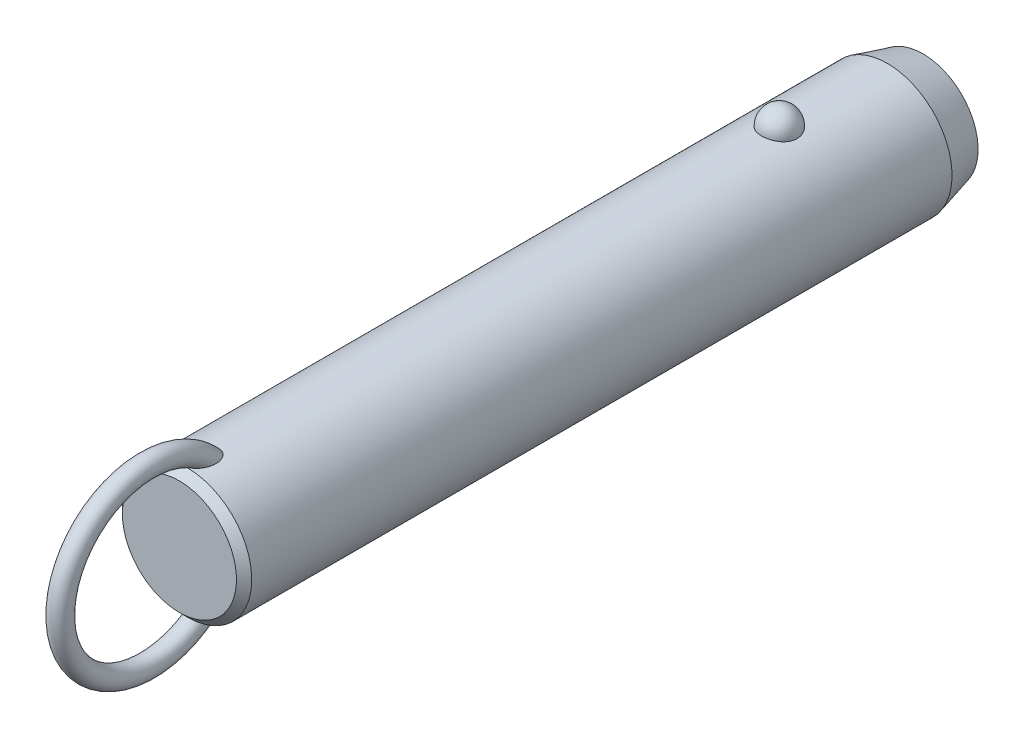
ISO-10303-21;
HEADER;
FILE_DESCRIPTION(('STEP AP214'),'2;1');
FILE_NAME('part.step','',(''),(''),'','','');
FILE_SCHEMA(('AUTOMOTIVE_DESIGN { 1 0 10303 214 1 1 1 1 }'));
ENDSEC;
DATA;
#1=APPLICATION_CONTEXT('core data for automotive mechanical design processes');
#2=APPLICATION_PROTOCOL_DEFINITION('international standard','automotive_design',2000,#1);
#3=PRODUCT_CONTEXT('',#1,'mechanical');
#4=PRODUCT('Part','Part','',(#3));
#5=PRODUCT_RELATED_PRODUCT_CATEGORY('part','',(#4));
#6=PRODUCT_DEFINITION_FORMATION('','',#4);
#7=PRODUCT_DEFINITION_CONTEXT('part definition',#1,'design');
#8=PRODUCT_DEFINITION('design','',#6,#7);
#9=PRODUCT_DEFINITION_SHAPE('','',#8);
#10=(LENGTH_UNIT() NAMED_UNIT(*) SI_UNIT(.MILLI.,.METRE.));
#11=(NAMED_UNIT(*) PLANE_ANGLE_UNIT() SI_UNIT($,.RADIAN.));
#12=(NAMED_UNIT(*) SI_UNIT($,.STERADIAN.) SOLID_ANGLE_UNIT());
#13=UNCERTAINTY_MEASURE_WITH_UNIT(LENGTH_MEASURE(1.E-05),#10,'distance_accuracy_value','');
#14=(GEOMETRIC_REPRESENTATION_CONTEXT(3) GLOBAL_UNCERTAINTY_ASSIGNED_CONTEXT((#13)) GLOBAL_UNIT_ASSIGNED_CONTEXT((#10,
#11,#12)) REPRESENTATION_CONTEXT('',''));
#15=CARTESIAN_POINT('',(0.,0.,0.));
#16=DIRECTION('',(0.,0.,1.));
#17=DIRECTION('',(1.,0.,0.));
#18=AXIS2_PLACEMENT_3D('',#15,#16,#17);
#19=CARTESIAN_POINT('',(0.,0.,101.6));
#20=DIRECTION('',(0.,0.,-1.));
#21=DIRECTION('',(-1.,0.,0.));
#22=AXIS2_PLACEMENT_3D('',#19,#20,#21);
#23=CYLINDRICAL_SURFACE('',#22,12.7);
#24=CARTESIAN_POINT('',(3.46661256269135,12.2177165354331,-3.5));
#25=CARTESIAN_POINT('',(3.4666090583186,12.2177194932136,-3.30432790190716));
#26=CARTESIAN_POINT('',(3.45063567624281,12.2222841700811,-3.10861112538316));
#27=CARTESIAN_POINT('',(3.38712451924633,12.2400345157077,-2.72271899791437));
#28=CARTESIAN_POINT('',(3.33957415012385,12.2532236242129,-2.53254588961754));
#29=CARTESIAN_POINT('',(3.2141234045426,12.286724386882,-2.16324948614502));
#30=CARTESIAN_POINT('',(3.13623639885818,12.3070329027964,-1.98412136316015));
#31=CARTESIAN_POINT('',(2.95205930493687,12.3525018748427,-1.64180592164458));
#32=CARTESIAN_POINT('',(2.84577003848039,12.3776621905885,-1.47861814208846));
#33=CARTESIAN_POINT('',(2.60688050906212,12.4301712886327,-1.17190583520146));
#34=CARTESIAN_POINT('',(2.47415697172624,12.4575299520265,-1.02847897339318));
#35=CARTESIAN_POINT('',(2.18615174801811,12.5112810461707,-0.766177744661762));
#36=CARTESIAN_POINT('',(2.03087002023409,12.5376734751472,-0.64730342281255));
#37=CARTESIAN_POINT('',(1.70237334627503,12.5864761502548,-0.437732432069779));
#38=CARTESIAN_POINT('',(1.52920948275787,12.6088972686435,-0.346958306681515));
#39=CARTESIAN_POINT('',(1.16944170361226,12.6473352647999,-0.195750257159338));
#40=CARTESIAN_POINT('',(0.982839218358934,12.663352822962,-0.135313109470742));
#41=CARTESIAN_POINT('',(0.604961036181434,12.6869706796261,-0.0473241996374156));
#42=CARTESIAN_POINT('',(0.41382314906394,12.6947125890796,-0.0192185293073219));
#43=CARTESIAN_POINT('',(0.0293827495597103,12.7014203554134,0.0051725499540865));
#44=CARTESIAN_POINT('',(-0.163919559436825,12.7003870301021,0.00146092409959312));
#45=CARTESIAN_POINT('',(-0.544374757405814,12.689735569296,-0.0373939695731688));
#46=CARTESIAN_POINT('',(-0.731575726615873,12.6802364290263,-0.0721015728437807));
#47=CARTESIAN_POINT('',(-1.09733277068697,12.6538333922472,-0.171364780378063));
#48=CARTESIAN_POINT('',(-1.27588869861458,12.6369293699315,-0.235920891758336));
#49=CARTESIAN_POINT('',(-1.6204698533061,12.5973946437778,-0.393548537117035));
#50=CARTESIAN_POINT('',(-1.78641865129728,12.5747321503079,-0.486778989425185));
#51=CARTESIAN_POINT('',(-2.10030671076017,12.5261316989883,-0.699110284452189));
#52=CARTESIAN_POINT('',(-2.24824419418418,12.5001934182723,-0.818213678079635));
#53=CARTESIAN_POINT('',(-2.52491489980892,12.4472906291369,-1.08157124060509));
#54=CARTESIAN_POINT('',(-2.65324222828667,12.4203160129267,-1.22624992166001));
#55=CARTESIAN_POINT('',(-2.88410007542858,12.3687509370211,-1.53528325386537));
#56=CARTESIAN_POINT('',(-2.98662883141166,12.3441606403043,-1.69963924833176));
#57=CARTESIAN_POINT('',(-3.16432417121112,12.2998199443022,-2.04548497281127));
#58=CARTESIAN_POINT('',(-3.23917525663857,12.2801261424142,-2.22714424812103));
#59=CARTESIAN_POINT('',(-3.35800573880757,12.248167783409,-2.6009138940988));
#60=CARTESIAN_POINT('',(-3.4019860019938,12.2359030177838,-2.79302397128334));
#61=CARTESIAN_POINT('',(-3.45784812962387,12.2202347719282,-3.18140279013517));
#62=CARTESIAN_POINT('',(-3.46986123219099,12.2167950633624,-3.37765118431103));
#63=CARTESIAN_POINT('',(-3.46186273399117,12.2190638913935,-3.76943689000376));
#64=CARTESIAN_POINT('',(-3.44185196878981,12.2247721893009,-3.96497421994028));
#65=CARTESIAN_POINT('',(-3.37048652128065,12.2446381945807,-4.34881728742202));
#66=CARTESIAN_POINT('',(-3.31928253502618,12.2587552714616,-4.53715319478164));
#67=CARTESIAN_POINT('',(-3.18693461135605,12.2938237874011,-4.90231727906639));
#68=CARTESIAN_POINT('',(-3.1057895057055,12.3147754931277,-5.07914500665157));
#69=CARTESIAN_POINT('',(-2.91506431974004,12.3613125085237,-5.41732059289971));
#70=CARTESIAN_POINT('',(-2.80533587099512,12.3869217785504,-5.57858147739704));
#71=CARTESIAN_POINT('',(-2.560414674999,12.4398525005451,-5.88013283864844));
#72=CARTESIAN_POINT('',(-2.42522099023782,12.4671740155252,-6.02042254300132));
#73=CARTESIAN_POINT('',(-2.1323357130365,12.5205965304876,-6.27662798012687));
#74=CARTESIAN_POINT('',(-1.97456596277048,12.5466928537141,-6.3924554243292));
#75=CARTESIAN_POINT('',(-1.64115839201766,12.5946384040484,-6.59583547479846));
#76=CARTESIAN_POINT('',(-1.46552179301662,12.6164879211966,-6.68339001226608));
#77=CARTESIAN_POINT('',(-1.10356050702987,12.6532533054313,-6.82682153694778));
#78=CARTESIAN_POINT('',(-0.9173913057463,12.6682500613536,-6.8830698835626));
#79=CARTESIAN_POINT('',(-0.537836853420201,12.6900288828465,-6.96386887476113));
#80=CARTESIAN_POINT('',(-0.344452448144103,12.6968119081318,-6.9884232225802));
#81=CARTESIAN_POINT('',(0.0402577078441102,12.7013667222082,-7.00496469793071));
#82=CARTESIAN_POINT('',(0.231556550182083,12.6993008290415,-6.99753844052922));
#83=CARTESIAN_POINT('',(0.610105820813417,12.6867505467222,-6.9516636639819));
#84=CARTESIAN_POINT('',(0.797356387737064,12.6762664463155,-6.913216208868));
#85=CARTESIAN_POINT('',(1.16186657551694,12.6480587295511,-6.80658431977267));
#86=CARTESIAN_POINT('',(1.33915951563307,12.6303611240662,-6.73850666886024));
#87=CARTESIAN_POINT('',(1.67968518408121,12.5896027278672,-6.5745087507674));
#88=CARTESIAN_POINT('',(1.84291705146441,12.5665416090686,-6.47858678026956));
#89=CARTESIAN_POINT('',(2.15340192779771,12.5171072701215,-6.25982455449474));
#90=CARTESIAN_POINT('',(2.30037831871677,12.4906895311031,-6.13660186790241));
#91=CARTESIAN_POINT('',(2.5717412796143,12.4376567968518,-5.86739587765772));
#92=CARTESIAN_POINT('',(2.69612388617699,12.4110417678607,-5.72140858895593));
#93=CARTESIAN_POINT('',(2.92107785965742,12.360051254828,-5.40794137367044));
#94=CARTESIAN_POINT('',(3.02121329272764,12.3357209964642,-5.24014110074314));
#95=CARTESIAN_POINT('',(3.19236291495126,12.2925446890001,-4.88969865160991));
#96=CARTESIAN_POINT('',(3.26338839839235,12.2736965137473,-4.70706226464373));
#97=CARTESIAN_POINT('',(3.36788038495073,12.245404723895,-4.35469510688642));
#98=CARTESIAN_POINT('',(3.40484026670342,12.2351018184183,-4.18605935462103));
#99=CARTESIAN_POINT('',(3.45420764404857,12.2212564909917,-3.84496058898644));
#100=CARTESIAN_POINT('',(3.46661565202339,12.2177139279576,-3.67249765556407));
#101=CARTESIAN_POINT('',(3.46661256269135,12.2177165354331,-3.5));
#102=B_SPLINE_CURVE_WITH_KNOTS('',3,(#24,#25,#26,#27,#28,#29,#30,#31,#32,#33,#34,#35,#36,#37,
#38,#39,#40,#41,#42,#43,#44,#45,#46,#47,#48,#49,#50,#51,#52,#53,#54,#55,#56,#57,#58,#59,#60,#61,
#62,#63,#64,#65,#66,#67,#68,#69,#70,#71,#72,#73,#74,#75,#76,#77,#78,#79,#80,#81,#82,#83,#84,#85,
#86,#87,#88,#89,#90,#91,#92,#93,#94,#95,#96,#97,#98,#99,#100,#101),.UNSPECIFIED.,.T.,.F.,(4,2,2,
2,2,2,2,2,2,2,2,2,2,2,2,2,2,2,2,2,2,2,2,2,2,2,2,2,2,2,2,2,2,2,2,2,2,2,4),(0.,0.586396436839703,
1.17302689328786,1.7593990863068,2.34575431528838,2.93491084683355,3.52406845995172,
4.11158733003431,4.69904375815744,5.2762784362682,5.85345931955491,6.42265312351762,
6.99185659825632,7.56427334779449,8.136746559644,8.71981013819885,9.3029135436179,
9.89247258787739,10.4820150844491,11.0691335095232,11.6562366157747,12.2405256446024,
12.8248374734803,13.412244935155,13.9996740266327,14.5891883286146,15.1786623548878,
15.7609861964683,16.3432419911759,16.9148635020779,17.4864654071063,18.0560241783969,
18.6256177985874,19.2037609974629,19.7820055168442,20.3699810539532,20.957728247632,
21.4746855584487,21.9916320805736),.UNSPECIFIED.);
#103=CARTESIAN_POINT('',(3.46661256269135,12.2177165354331,-3.5));
#104=VERTEX_POINT('',#103);
#105=EDGE_CURVE('E41',#104,#104,#102,.T.);
#106=ORIENTED_EDGE('',*,*,#105,.T.);
#107=EDGE_LOOP('',(#106));
#108=FACE_BOUND('',#107,.T.);
#109=CARTESIAN_POINT('',(0.,0.,112.8));
#110=DIRECTION('',(0.,0.,1.));
#111=DIRECTION('',(1.,0.,0.));
#112=AXIS2_PLACEMENT_3D('',#109,#110,#111);
#113=CIRCLE('',#112,12.7);
#114=CARTESIAN_POINT('',(-12.7,0.,112.8));
#115=VERTEX_POINT('',#114);
#116=EDGE_CURVE('E10',#115,#115,#113,.F.);
#117=ORIENTED_EDGE('',*,*,#116,.T.);
#118=EDGE_LOOP('',(#117));
#119=FACE_BOUND('',#118,.T.);
#120=CARTESIAN_POINT('',(-0.548122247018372,-12.6881662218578,106.543218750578));
#121=CARTESIAN_POINT('',(-0.648865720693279,-12.6838128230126,106.577926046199));
#122=CARTESIAN_POINT('',(-0.746398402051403,-12.6783867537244,106.622042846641));
#123=CARTESIAN_POINT('',(-0.93212506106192,-12.666091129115,106.726764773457));
#124=CARTESIAN_POINT('',(-1.02030388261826,-12.6592192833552,106.787396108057));
#125=CARTESIAN_POINT('',(-1.18487740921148,-12.6448747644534,106.921847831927));
#126=CARTESIAN_POINT('',(-1.26134296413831,-12.637406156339,106.995582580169));
#127=CARTESIAN_POINT('',(-1.4023120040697,-12.6225412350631,107.153604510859));
#128=CARTESIAN_POINT('',(-1.46681470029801,-12.6151449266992,107.23789238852));
#129=CARTESIAN_POINT('',(-1.60714786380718,-12.5981718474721,107.449657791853));
#130=CARTESIAN_POINT('',(-1.67725126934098,-12.588900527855,107.580962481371));
#131=CARTESIAN_POINT('',(-1.79536591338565,-12.5725964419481,107.853247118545));
#132=CARTESIAN_POINT('',(-1.84333535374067,-12.5655679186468,107.994244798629));
#133=CARTESIAN_POINT('',(-1.93422576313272,-12.5519624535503,108.337645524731));
#134=CARTESIAN_POINT('',(-1.96788773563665,-12.5466298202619,108.542557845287));
#135=CARTESIAN_POINT('',(-1.9941399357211,-12.542463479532,108.851760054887));
#136=CARTESIAN_POINT('',(-1.99883864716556,-12.5417153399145,108.955298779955));
#137=CARTESIAN_POINT('',(-2.00078003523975,-12.5414074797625,109.16245124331));
#138=CARTESIAN_POINT('',(-1.99802449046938,-12.5418474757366,109.266064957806));
#139=CARTESIAN_POINT('',(-1.98336733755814,-12.5441750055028,109.510320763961));
#140=CARTESIAN_POINT('',(-1.96851430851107,-12.5465291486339,109.650780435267));
#141=CARTESIAN_POINT('',(-1.92707089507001,-12.5529612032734,109.929960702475));
#142=CARTESIAN_POINT('',(-1.90047458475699,-12.5570399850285,110.068680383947));
#143=CARTESIAN_POINT('',(-1.83619120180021,-12.5666008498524,110.34341135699));
#144=CARTESIAN_POINT('',(-1.79850828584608,-12.57208240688,110.479423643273));
#145=CARTESIAN_POINT('',(-1.71223796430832,-12.5841228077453,110.747842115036));
#146=CARTESIAN_POINT('',(-1.66365679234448,-12.5906810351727,110.880250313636));
#147=CARTESIAN_POINT('',(-1.5780450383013,-12.6016176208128,111.08548877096));
#148=CARTESIAN_POINT('',(-1.54477252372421,-12.6057501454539,111.159914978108));
#149=CARTESIAN_POINT('',(-1.47424480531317,-12.6141930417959,111.306839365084));
#150=CARTESIAN_POINT('',(-1.43699041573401,-12.6185033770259,111.379337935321));
#151=CARTESIAN_POINT('',(-1.35825795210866,-12.6272207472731,111.521892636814));
#152=CARTESIAN_POINT('',(-1.31678520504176,-12.6316276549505,111.591951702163));
#153=CARTESIAN_POINT('',(-1.22917793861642,-12.6404532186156,111.729070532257));
#154=CARTESIAN_POINT('',(-1.18304514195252,-12.6448718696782,111.796131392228));
#155=CARTESIAN_POINT('',(-1.07246411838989,-12.6547893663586,111.943874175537));
#156=CARTESIAN_POINT('',(-1.00642239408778,-12.6602600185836,112.023384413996));
#157=CARTESIAN_POINT('',(-0.864441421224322,-12.6707460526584,112.173169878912));
#158=CARTESIAN_POINT('',(-0.788516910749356,-12.6757620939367,112.243458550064));
#159=CARTESIAN_POINT('',(-0.652215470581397,-12.6833591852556,112.348680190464));
#160=CARTESIAN_POINT('',(-0.594982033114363,-12.6861973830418,112.387624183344));
#161=CARTESIAN_POINT('',(-0.475269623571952,-12.6912445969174,112.456489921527));
#162=CARTESIAN_POINT('',(-0.412800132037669,-12.6934547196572,112.486427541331));
#163=CARTESIAN_POINT('',(-0.295749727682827,-12.6966636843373,112.529756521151));
#164=CARTESIAN_POINT('',(-0.241949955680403,-12.6978134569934,112.545218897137));
#165=CARTESIAN_POINT('',(-0.132508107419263,-12.6994261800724,112.566884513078));
#166=CARTESIAN_POINT('',(-0.0768679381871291,-12.6998898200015,112.573097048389));
#167=CARTESIAN_POINT('',(0.0347696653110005,-12.7000752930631,112.575583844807));
#168=CARTESIAN_POINT('',(0.0907676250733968,-12.6997954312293,112.571835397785));
#169=CARTESIAN_POINT('',(0.20128301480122,-12.6985255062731,112.554788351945));
#170=CARTESIAN_POINT('',(0.255799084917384,-12.6975348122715,112.541481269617));
#171=CARTESIAN_POINT('',(0.376042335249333,-12.6946091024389,112.50203792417));
#172=CARTESIAN_POINT('',(0.44095085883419,-12.6924943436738,112.473449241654));
#173=CARTESIAN_POINT('',(0.565350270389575,-12.6875639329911,112.406323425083));
#174=CARTESIAN_POINT('',(0.624828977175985,-12.6847467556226,112.367764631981));
#175=CARTESIAN_POINT('',(0.774116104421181,-12.6767252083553,112.256949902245));
#176=CARTESIAN_POINT('',(0.859449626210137,-12.6711344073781,112.178760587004));
#177=CARTESIAN_POINT('',(1.01789440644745,-12.6593922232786,112.010943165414));
#178=CARTESIAN_POINT('',(1.09096902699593,-12.653239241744,111.921282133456));
#179=CARTESIAN_POINT('',(1.22268793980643,-12.6411674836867,111.740265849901));
#180=CARTESIAN_POINT('',(1.28193986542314,-12.6352572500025,111.649345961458));
#181=CARTESIAN_POINT('',(1.39259777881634,-12.6235401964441,111.462792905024));
#182=CARTESIAN_POINT('',(1.44399707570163,-12.6177334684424,111.367155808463));
#183=CARTESIAN_POINT('',(1.53972870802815,-12.6064093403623,111.172273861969));
#184=CARTESIAN_POINT('',(1.58405262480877,-12.6008922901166,111.073024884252));
#185=CARTESIAN_POINT('',(1.66600705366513,-12.5903187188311,110.871772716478));
#186=CARTESIAN_POINT('',(1.70363651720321,-12.5852622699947,110.769769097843));
#187=CARTESIAN_POINT('',(1.77545379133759,-12.5753406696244,110.554358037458));
#188=CARTESIAN_POINT('',(1.80903453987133,-12.5705328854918,110.440745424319));
#189=CARTESIAN_POINT('',(1.86844163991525,-12.5618400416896,110.211457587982));
#190=CARTESIAN_POINT('',(1.89426665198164,-12.5579551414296,110.095782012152));
#191=CARTESIAN_POINT('',(1.9378546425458,-12.5513030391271,109.863007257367));
#192=CARTESIAN_POINT('',(1.9556264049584,-12.5485346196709,109.745909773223));
#193=CARTESIAN_POINT('',(1.98264463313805,-12.5442934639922,109.510747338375));
#194=CARTESIAN_POINT('',(1.99189298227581,-12.5428204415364,109.39268260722));
#195=CARTESIAN_POINT('',(2.00416068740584,-12.540871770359,109.080622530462));
#196=CARTESIAN_POINT('',(1.99944433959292,-12.541631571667,108.886229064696));
#197=CARTESIAN_POINT('',(1.96113755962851,-12.5476846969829,108.500309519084));
#198=CARTESIAN_POINT('',(1.92758341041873,-12.5529723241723,108.308780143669));
#199=CARTESIAN_POINT('',(1.83934342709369,-12.5661532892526,107.982272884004));
#200=CARTESIAN_POINT('',(1.79215440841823,-12.5730485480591,107.84524997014));
#201=CARTESIAN_POINT('',(1.67676242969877,-12.588958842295,107.580445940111));
#202=CARTESIAN_POINT('',(1.60859050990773,-12.597970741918,107.452651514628));
#203=CARTESIAN_POINT('',(1.46583832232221,-12.6152829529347,107.235800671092));
#204=CARTESIAN_POINT('',(1.39525727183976,-12.6233659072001,107.14410500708));
#205=CARTESIAN_POINT('',(1.23992594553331,-12.6395676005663,106.973485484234));
#206=CARTESIAN_POINT('',(1.1551793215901,-12.6476863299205,106.894558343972));
#207=CARTESIAN_POINT('',(0.971995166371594,-12.6630846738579,106.752643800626));
#208=CARTESIAN_POINT('',(0.873456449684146,-12.6703572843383,106.689784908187));
#209=CARTESIAN_POINT('',(0.665847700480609,-12.6829569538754,106.584487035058));
#210=CARTESIAN_POINT('',(0.556784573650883,-12.688285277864,106.542034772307));
#211=CARTESIAN_POINT('',(0.347338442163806,-12.6956226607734,106.484443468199));
#212=CARTESIAN_POINT('',(0.247759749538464,-12.6979816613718,106.466399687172));
#213=CARTESIAN_POINT('',(0.0470218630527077,-12.7003077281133,106.448600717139));
#214=CARTESIAN_POINT('',(-0.0541350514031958,-12.7002779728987,106.448821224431));
#215=CARTESIAN_POINT('',(-0.221414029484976,-12.6982482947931,106.464363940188));
#216=CARTESIAN_POINT('',(-0.288055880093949,-12.6969033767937,106.474666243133));
#217=CARTESIAN_POINT('',(-0.419599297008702,-12.6932369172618,106.50313489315));
#218=CARTESIAN_POINT('',(-0.484501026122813,-12.6909154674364,106.521300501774));
#219=CARTESIAN_POINT('',(-0.548122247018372,-12.6881662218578,106.543218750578));
#220=B_SPLINE_CURVE_WITH_KNOTS('',3,(#120,#121,#122,#123,#124,#125,#126,#127,#128,#129,#130,
#131,#132,#133,#134,#135,#136,#137,#138,#139,#140,#141,#142,#143,#144,#145,#146,#147,#148,#149,
#150,#151,#152,#153,#154,#155,#156,#157,#158,#159,#160,#161,#162,#163,#164,#165,#166,#167,#168,
#169,#170,#171,#172,#173,#174,#175,#176,#177,#178,#179,#180,#181,#182,#183,#184,#185,#186,#187,
#188,#189,#190,#191,#192,#193,#194,#195,#196,#197,#198,#199,#200,#201,#202,#203,#204,#205,#206,
#207,#208,#209,#210,#211,#212,#213,#214,#215,#216,#217,#218,#219),.UNSPECIFIED.,.T.,.F.,(4,2,2,
2,2,2,2,2,2,2,2,2,2,2,2,2,2,2,2,2,2,2,2,2,2,2,2,2,2,2,2,2,2,2,2,2,2,2,2,2,2,2,2,2,2,2,2,2,2,4),
(0.,0.31964225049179,0.639794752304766,0.957927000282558,1.27608021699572,1.72100165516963,
2.16675988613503,2.78630021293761,3.0970578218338,3.40774128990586,3.83096358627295,
4.2543996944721,4.67767724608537,5.10071330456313,5.34550297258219,5.59024267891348,
5.83467707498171,6.07902143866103,6.38891080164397,6.69834321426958,6.90560910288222,
7.11250749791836,7.27977315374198,7.44687060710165,7.61434932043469,7.78197685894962,
7.99365544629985,8.20579780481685,8.55147335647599,8.89816429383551,9.22375138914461,
9.5496143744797,9.87586224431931,10.202161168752,10.557587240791,10.9130746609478,
11.2681734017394,11.6231936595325,12.2046601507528,12.7853961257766,13.219164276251,
13.6522938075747,13.9989174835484,14.3454519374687,14.6946768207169,15.0436740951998,
15.3457513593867,15.6474266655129,15.8493051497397,16.0511646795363),.UNSPECIFIED.);
#221=CARTESIAN_POINT('',(-0.548122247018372,-12.6881662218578,106.543218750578));
#222=VERTEX_POINT('',#221);
#223=EDGE_CURVE('E60',#222,#222,#220,.T.);
#224=ORIENTED_EDGE('',*,*,#223,.T.);
#225=EDGE_LOOP('',(#224));
#226=FACE_BOUND('',#225,.T.);
#227=CARTESIAN_POINT('',(-0.548122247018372,12.6881662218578,106.543218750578));
#228=CARTESIAN_POINT('',(-0.459436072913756,12.6919968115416,106.512673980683));
#229=CARTESIAN_POINT('',(-0.368189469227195,12.6949996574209,106.489391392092));
#230=CARTESIAN_POINT('',(-0.183024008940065,12.6990186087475,106.458406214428));
#231=CARTESIAN_POINT('',(-0.0891049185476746,12.7000345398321,106.450704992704));
#232=CARTESIAN_POINT('',(0.0987147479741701,12.6999636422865,106.451245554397));
#233=CARTESIAN_POINT('',(0.192615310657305,12.6988761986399,106.459492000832));
#234=CARTESIAN_POINT('',(0.377658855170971,12.6947211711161,106.491551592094));
#235=CARTESIAN_POINT('',(0.468801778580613,12.6916535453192,106.515365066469));
#236=CARTESIAN_POINT('',(0.645809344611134,12.6838788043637,106.57745651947));
#237=CARTESIAN_POINT('',(0.731679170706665,12.6791733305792,106.615720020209));
#238=CARTESIAN_POINT('',(0.896315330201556,12.6686004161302,106.705120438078));
#239=CARTESIAN_POINT('',(0.975080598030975,12.6627328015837,106.756259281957));
#240=CARTESIAN_POINT('',(1.12963655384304,12.6499161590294,106.87367820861));
#241=CARTESIAN_POINT('',(1.20478673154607,12.6429194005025,106.940792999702));
#242=CARTESIAN_POINT('',(1.34448241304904,12.6288282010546,107.08522507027));
#243=CARTESIAN_POINT('',(1.40902173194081,12.621733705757,107.162548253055));
#244=CARTESIAN_POINT('',(1.55208211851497,12.6050877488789,107.359247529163));
#245=CARTESIAN_POINT('',(1.62510490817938,12.5957546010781,107.482654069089));
#246=CARTESIAN_POINT('',(1.75019044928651,12.5789823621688,107.739769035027));
#247=CARTESIAN_POINT('',(1.80221377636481,12.5715468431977,107.873496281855));
#248=CARTESIAN_POINT('',(1.90309965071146,12.5567434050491,108.198351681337));
#249=CARTESIAN_POINT('',(1.94342317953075,12.5504515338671,108.392161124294));
#250=CARTESIAN_POINT('',(1.99332997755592,12.5426147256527,108.78378810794));
#251=CARTESIAN_POINT('',(2.00285305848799,12.5410790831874,108.981612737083));
#252=CARTESIAN_POINT('',(1.99678999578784,12.5420407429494,109.316642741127));
#253=CARTESIAN_POINT('',(1.98794117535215,12.5434564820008,109.454042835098));
#254=CARTESIAN_POINT('',(1.95865119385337,12.5480641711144,109.727639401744));
#255=CARTESIAN_POINT('',(1.9382043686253,12.5512569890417,109.863835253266));
#256=CARTESIAN_POINT('',(1.88647896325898,12.5591352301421,110.134249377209));
#257=CARTESIAN_POINT('',(1.85518800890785,12.5638223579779,110.26846520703));
#258=CARTESIAN_POINT('',(1.78217886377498,12.5743868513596,110.533936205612));
#259=CARTESIAN_POINT('',(1.74046509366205,12.5802637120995,110.665192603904));
#260=CARTESIAN_POINT('',(1.66024095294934,12.5910571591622,110.886085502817));
#261=CARTESIAN_POINT('',(1.62434772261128,12.5957535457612,110.976690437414));
#262=CARTESIAN_POINT('',(1.54709009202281,12.6054762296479,111.155512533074));
#263=CARTESIAN_POINT('',(1.50572681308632,12.6105024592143,111.243730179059));
#264=CARTESIAN_POINT('',(1.41728020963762,12.620748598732,111.416932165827));
#265=CARTESIAN_POINT('',(1.37021377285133,12.625967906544,111.501925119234));
#266=CARTESIAN_POINT('',(1.26969620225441,12.6364721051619,111.668007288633));
#267=CARTESIAN_POINT('',(1.21624929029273,12.6417569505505,111.749099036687));
#268=CARTESIAN_POINT('',(1.10304413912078,12.6521331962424,111.904702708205));
#269=CARTESIAN_POINT('',(1.04340936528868,12.657226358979,111.979303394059));
#270=CARTESIAN_POINT('',(0.91591933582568,12.6670906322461,112.121324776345));
#271=CARTESIAN_POINT('',(0.84806456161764,12.6718617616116,112.18874589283));
#272=CARTESIAN_POINT('',(0.717035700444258,12.67987711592,112.300624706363));
#273=CARTESIAN_POINT('',(0.655526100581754,12.6832377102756,112.346997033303));
#274=CARTESIAN_POINT('',(0.525985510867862,12.6892676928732,112.429619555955));
#275=CARTESIAN_POINT('',(0.45796984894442,12.6919386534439,112.465892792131));
#276=CARTESIAN_POINT('',(0.334859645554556,12.695691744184,112.516657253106));
#277=CARTESIAN_POINT('',(0.281116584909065,12.6970073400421,112.534373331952));
#278=CARTESIAN_POINT('',(0.171425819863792,12.6989609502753,112.560642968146));
#279=CARTESIAN_POINT('',(0.11548082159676,12.699599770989,112.569207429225));
#280=CARTESIAN_POINT('',(0.00272618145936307,12.7001251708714,112.576253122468));
#281=CARTESIAN_POINT('',(-0.0540859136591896,12.7000089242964,112.574696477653));
#282=CARTESIAN_POINT('',(-0.166544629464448,12.6990328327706,112.561600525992));
#283=CARTESIAN_POINT('',(-0.222190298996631,12.6981724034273,112.550053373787));
#284=CARTESIAN_POINT('',(-0.342018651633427,12.695562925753,112.514912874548));
#285=CARTESIAN_POINT('',(-0.405606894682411,12.6936676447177,112.48933225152));
#286=CARTESIAN_POINT('',(-0.527815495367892,12.6891754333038,112.428311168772));
#287=CARTESIAN_POINT('',(-0.586425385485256,12.6865770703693,112.392850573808));
#288=CARTESIAN_POINT('',(-0.731842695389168,12.6792129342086,112.291496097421));
#289=CARTESIAN_POINT('',(-0.814709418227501,12.6740767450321,112.2200395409));
#290=CARTESIAN_POINT('',(-0.969101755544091,12.6632083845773,112.06589007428));
#291=CARTESIAN_POINT('',(-1.04059564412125,12.6574746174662,111.983166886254));
#292=CARTESIAN_POINT('',(-1.16981116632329,12.6461638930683,111.815809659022));
#293=CARTESIAN_POINT('',(-1.22811369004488,12.6405994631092,111.731616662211));
#294=CARTESIAN_POINT('',(-1.33743405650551,12.6295007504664,111.558579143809));
#295=CARTESIAN_POINT('',(-1.38844577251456,12.6239664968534,111.469730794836));
#296=CARTESIAN_POINT('',(-1.48400702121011,12.6130898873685,111.288389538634));
#297=CARTESIAN_POINT('',(-1.52854232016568,12.6077479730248,111.195889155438));
#298=CARTESIAN_POINT('',(-1.6115011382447,12.5974127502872,111.008160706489));
#299=CARTESIAN_POINT('',(-1.64992317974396,12.5924195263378,110.912931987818));
#300=CARTESIAN_POINT('',(-1.73468589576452,12.581070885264,110.68289362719));
#301=CARTESIAN_POINT('',(-1.77831261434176,12.5749388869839,110.547066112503));
#302=CARTESIAN_POINT('',(-1.85439734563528,12.5639437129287,110.272212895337));
#303=CARTESIAN_POINT('',(-1.88684994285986,12.5590811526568,110.133185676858));
#304=CARTESIAN_POINT('',(-1.94008483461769,12.550968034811,109.85309235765));
#305=CARTESIAN_POINT('',(-1.96088706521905,12.5477147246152,109.712030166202));
#306=CARTESIAN_POINT('',(-1.99000539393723,12.5431291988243,109.428668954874));
#307=CARTESIAN_POINT('',(-1.99832911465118,12.5417958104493,109.286370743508));
#308=CARTESIAN_POINT('',(-2.00166624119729,12.5412674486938,108.957627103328));
#309=CARTESIAN_POINT('',(-1.99178843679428,12.5428579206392,108.771088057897));
#310=CARTESIAN_POINT('',(-1.9445518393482,12.5502731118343,108.40162404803));
#311=CARTESIAN_POINT('',(-1.90724032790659,12.5560905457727,108.218693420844));
#312=CARTESIAN_POINT('',(-1.81330718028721,12.5699462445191,107.904848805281));
#313=CARTESIAN_POINT('',(-1.76338820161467,12.5771273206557,107.771910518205));
#314=CARTESIAN_POINT('',(-1.64305018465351,12.593414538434,107.515681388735));
#315=CARTESIAN_POINT('',(-1.57265346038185,12.6025185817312,107.392380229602));
#316=CARTESIAN_POINT('',(-1.42634956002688,12.6198178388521,107.183564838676));
#317=CARTESIAN_POINT('',(-1.35423772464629,12.6278405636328,107.095384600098));
#318=CARTESIAN_POINT('',(-1.19645664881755,12.6437632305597,106.932107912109));
#319=CARTESIAN_POINT('',(-1.11080536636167,12.6516633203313,106.856994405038));
#320=CARTESIAN_POINT('',(-0.947219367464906,12.6648319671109,106.737811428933));
#321=CARTESIAN_POINT('',(-0.871624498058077,12.670300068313,106.690541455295));
#322=CARTESIAN_POINT('',(-0.714161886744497,12.6801492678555,106.6077413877));
#323=CARTESIAN_POINT('',(-0.632295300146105,12.684530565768,106.57220913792));
#324=CARTESIAN_POINT('',(-0.548122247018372,12.6881662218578,106.543218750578));
#325=B_SPLINE_CURVE_WITH_KNOTS('',3,(#227,#228,#229,#230,#231,#232,#233,#234,#235,#236,#237,
#238,#239,#240,#241,#242,#243,#244,#245,#246,#247,#248,#249,#250,#251,#252,#253,#254,#255,#256,
#257,#258,#259,#260,#261,#262,#263,#264,#265,#266,#267,#268,#269,#270,#271,#272,#273,#274,#275,
#276,#277,#278,#279,#280,#281,#282,#283,#284,#285,#286,#287,#288,#289,#290,#291,#292,#293,#294,
#295,#296,#297,#298,#299,#300,#301,#302,#303,#304,#305,#306,#307,#308,#309,#310,#311,#312,#313,
#314,#315,#316,#317,#318,#319,#320,#321,#322,#323,#324),.UNSPECIFIED.,.T.,.F.,(4,2,2,2,2,2,2,2,
2,2,2,2,2,2,2,2,2,2,2,2,2,2,2,2,2,2,2,2,2,2,2,2,2,2,2,2,2,2,2,2,2,2,2,2,2,2,2,2,4),(0.,
0.281328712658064,0.562682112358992,0.844117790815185,1.12555942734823,1.40671982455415,
1.68792232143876,1.98972294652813,2.29169886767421,2.72039860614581,3.14989948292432,
3.74084916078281,4.33295293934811,4.74554109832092,5.15833092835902,5.57159335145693,
5.98468079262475,6.27722775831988,6.5697148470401,6.86135609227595,7.15280542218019,
7.43927407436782,7.72572595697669,7.95635862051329,8.18646071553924,8.35559393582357,
8.52452541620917,8.69408946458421,8.86378678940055,9.06834348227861,9.27332014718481,
9.60010414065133,9.92778432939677,10.2350252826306,10.5425229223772,10.8506864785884,
11.1589244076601,11.5867893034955,12.0148612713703,12.4421984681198,12.8692745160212,
13.4279365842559,13.9856380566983,14.4107062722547,14.8353130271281,15.1765567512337,
15.5173516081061,15.7844129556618,16.051425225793),.UNSPECIFIED.);
#326=CARTESIAN_POINT('',(-0.548122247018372,12.6881662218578,106.543218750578));
#327=VERTEX_POINT('',#326);
#328=EDGE_CURVE('E67',#327,#327,#325,.T.);
#329=ORIENTED_EDGE('',*,*,#328,.T.);
#330=EDGE_LOOP('',(#329));
#331=FACE_BOUND('',#330,.T.);
#332=CARTESIAN_POINT('',(0.,0.,-24.6999999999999));
#333=DIRECTION('',(0.,0.,-1.));
#334=DIRECTION('',(-1.,0.,0.));
#335=AXIS2_PLACEMENT_3D('',#332,#333,#334);
#336=CIRCLE('',#335,12.7);
#337=CARTESIAN_POINT('',(-12.7,0.,-24.6999999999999));
#338=VERTEX_POINT('',#337);
#339=EDGE_CURVE('E57',#338,#338,#336,.F.);
#340=ORIENTED_EDGE('',*,*,#339,.T.);
#341=EDGE_LOOP('',(#340));
#342=FACE_BOUND('',#341,.T.);
#343=ADVANCED_FACE('F37',(#108,#119,#226,#331,#342),#23,.T.);
#344=CARTESIAN_POINT('',(0.,0.,-31.7));
#345=DIRECTION('',(0.,0.,-1.));
#346=DIRECTION('',(-1.,0.,0.));
#347=AXIS2_PLACEMENT_3D('',#344,#345,#346);
#348=PLANE('',#347);
#349=CARTESIAN_POINT('',(0.,0.,-31.7));
#350=DIRECTION('',(0.,0.,-1.));
#351=DIRECTION('',(-1.,0.,0.));
#352=AXIS2_PLACEMENT_3D('',#349,#350,#351);
#353=CIRCLE('',#352,10.8243556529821);
#354=CARTESIAN_POINT('',(-10.8243556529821,0.,-31.7));
#355=VERTEX_POINT('',#354);
#356=EDGE_CURVE('E66',#355,#355,#353,.T.);
#357=ORIENTED_EDGE('',*,*,#356,.T.);
#358=EDGE_LOOP('',(#357));
#359=FACE_BOUND('',#358,.T.);
#360=ADVANCED_FACE('F85',(#359),#348,.T.);
#361=CARTESIAN_POINT('',(0.,0.,-31.7));
#362=DIRECTION('',(0.,0.,1.));
#363=DIRECTION('',(1.,0.,0.));
#364=AXIS2_PLACEMENT_3D('',#361,#362,#363);
#365=CONICAL_SURFACE('',#364,10.8243556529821,0.261799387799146);
#366=ORIENTED_EDGE('',*,*,#339,.F.);
#367=EDGE_LOOP('',(#366));
#368=FACE_BOUND('',#367,.T.);
#369=ORIENTED_EDGE('',*,*,#356,.F.);
#370=EDGE_LOOP('',(#369));
#371=FACE_BOUND('',#370,.T.);
#372=ADVANCED_FACE('F83',(#368,#371),#365,.T.);
#373=CARTESIAN_POINT('',(0.,0.,114.3));
#374=DIRECTION('',(0.,0.,1.));
#375=DIRECTION('',(1.,0.,0.));
#376=AXIS2_PLACEMENT_3D('',#373,#374,#375);
#377=PLANE('',#376);
#378=CARTESIAN_POINT('',(0.,0.,114.3));
#379=DIRECTION('',(0.,0.,1.));
#380=DIRECTION('',(1.,0.,0.));
#381=AXIS2_PLACEMENT_3D('',#378,#379,#380);
#382=CIRCLE('',#381,11.2);
#383=CARTESIAN_POINT('',(-11.2,0.,114.3));
#384=VERTEX_POINT('',#383);
#385=EDGE_CURVE('E50',#384,#384,#382,.T.);
#386=ORIENTED_EDGE('',*,*,#385,.T.);
#387=EDGE_LOOP('',(#386));
#388=FACE_BOUND('',#387,.T.);
#389=ADVANCED_FACE('F77',(#388),#377,.T.);
#390=CARTESIAN_POINT('',(0.,0.,120.65));
#391=DIRECTION('',(1.,0.,0.));
#392=DIRECTION('',(0.,0.,-1.));
#393=AXIS2_PLACEMENT_3D('',#390,#391,#392);
#394=TOROIDAL_SURFACE('',#393,17.05,2.);
#395=ORIENTED_EDGE('',*,*,#328,.F.);
#396=EDGE_LOOP('',(#395));
#397=FACE_BOUND('',#396,.T.);
#398=ORIENTED_EDGE('',*,*,#223,.F.);
#399=EDGE_LOOP('',(#398));
#400=FACE_BOUND('',#399,.T.);
#401=ADVANCED_FACE('F73',(#397,#400),#394,.T.);
#402=CARTESIAN_POINT('',(0.,0.,114.3));
#403=DIRECTION('',(0.,0.,-1.));
#404=DIRECTION('',(-1.,0.,0.));
#405=AXIS2_PLACEMENT_3D('',#402,#403,#404);
#406=CONICAL_SURFACE('',#405,11.2,0.785398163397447);
#407=CARTESIAN_POINT('',(-12.7,0.,112.8));
#408=CARTESIAN_POINT('',(-12.684375,0.,112.815625));
#409=CARTESIAN_POINT('',(-12.66875,0.,112.83125));
#410=CARTESIAN_POINT('',(-12.6375,0.,112.8625));
#411=CARTESIAN_POINT('',(-12.621875,0.,112.878125));
#412=CARTESIAN_POINT('',(-12.590625,0.,112.909375));
#413=CARTESIAN_POINT('',(-12.575,0.,112.925));
#414=CARTESIAN_POINT('',(-12.54375,0.,112.95625));
#415=CARTESIAN_POINT('',(-12.528125,0.,112.971875));
#416=CARTESIAN_POINT('',(-12.496875,0.,113.003125));
#417=CARTESIAN_POINT('',(-12.48125,0.,113.01875));
#418=CARTESIAN_POINT('',(-12.45,0.,113.05));
#419=CARTESIAN_POINT('',(-12.434375,0.,113.065625));
#420=CARTESIAN_POINT('',(-12.403125,0.,113.096875));
#421=CARTESIAN_POINT('',(-12.3875,0.,113.1125));
#422=CARTESIAN_POINT('',(-12.35625,0.,113.14375));
#423=CARTESIAN_POINT('',(-12.340625,0.,113.159375));
#424=CARTESIAN_POINT('',(-12.309375,0.,113.190625));
#425=CARTESIAN_POINT('',(-12.29375,0.,113.20625));
#426=CARTESIAN_POINT('',(-12.2625,0.,113.2375));
#427=CARTESIAN_POINT('',(-12.246875,0.,113.253125));
#428=CARTESIAN_POINT('',(-12.215625,0.,113.284375));
#429=CARTESIAN_POINT('',(-12.2,0.,113.3));
#430=CARTESIAN_POINT('',(-12.16875,0.,113.33125));
#431=CARTESIAN_POINT('',(-12.153125,0.,113.346875));
#432=CARTESIAN_POINT('',(-12.121875,0.,113.378125));
#433=CARTESIAN_POINT('',(-12.10625,0.,113.39375));
#434=CARTESIAN_POINT('',(-12.075,0.,113.425));
#435=CARTESIAN_POINT('',(-12.059375,0.,113.440625));
#436=CARTESIAN_POINT('',(-12.028125,0.,113.471875));
#437=CARTESIAN_POINT('',(-12.0125,0.,113.4875));
#438=CARTESIAN_POINT('',(-11.98125,0.,113.51875));
#439=CARTESIAN_POINT('',(-11.965625,0.,113.534375));
#440=CARTESIAN_POINT('',(-11.934375,0.,113.565625));
#441=CARTESIAN_POINT('',(-11.91875,0.,113.58125));
#442=CARTESIAN_POINT('',(-11.8875,0.,113.6125));
#443=CARTESIAN_POINT('',(-11.871875,0.,113.628125));
#444=CARTESIAN_POINT('',(-11.840625,0.,113.659375));
#445=CARTESIAN_POINT('',(-11.825,0.,113.675));
#446=CARTESIAN_POINT('',(-11.79375,0.,113.70625));
#447=CARTESIAN_POINT('',(-11.778125,0.,113.721875));
#448=CARTESIAN_POINT('',(-11.746875,0.,113.753125));
#449=CARTESIAN_POINT('',(-11.73125,0.,113.76875));
#450=CARTESIAN_POINT('',(-11.7,0.,113.8));
#451=CARTESIAN_POINT('',(-11.684375,0.,113.815625));
#452=CARTESIAN_POINT('',(-11.653125,0.,113.846875));
#453=CARTESIAN_POINT('',(-11.6375,0.,113.8625));
#454=CARTESIAN_POINT('',(-11.60625,0.,113.89375));
#455=CARTESIAN_POINT('',(-11.590625,0.,113.909375));
#456=CARTESIAN_POINT('',(-11.559375,0.,113.940625));
#457=CARTESIAN_POINT('',(-11.54375,0.,113.95625));
#458=CARTESIAN_POINT('',(-11.5125,0.,113.9875));
#459=CARTESIAN_POINT('',(-11.496875,0.,114.003125));
#460=CARTESIAN_POINT('',(-11.465625,0.,114.034375));
#461=CARTESIAN_POINT('',(-11.45,0.,114.05));
#462=CARTESIAN_POINT('',(-11.41875,0.,114.08125));
#463=CARTESIAN_POINT('',(-11.403125,0.,114.096875));
#464=CARTESIAN_POINT('',(-11.371875,0.,114.128125));
#465=CARTESIAN_POINT('',(-11.35625,0.,114.14375));
#466=CARTESIAN_POINT('',(-11.325,0.,114.175));
#467=CARTESIAN_POINT('',(-11.309375,0.,114.190625));
#468=CARTESIAN_POINT('',(-11.278125,0.,114.221875));
#469=CARTESIAN_POINT('',(-11.2625,0.,114.2375));
#470=CARTESIAN_POINT('',(-11.23125,0.,114.26875));
#471=CARTESIAN_POINT('',(-11.215625,0.,114.284375));
#472=CARTESIAN_POINT('',(-11.2,0.,114.3));
#473=B_SPLINE_CURVE_WITH_KNOTS('',3,(#407,#408,#409,#410,#411,#412,#413,#414,#415,#416,#417,
#418,#419,#420,#421,#422,#423,#424,#425,#426,#427,#428,#429,#430,#431,#432,#433,#434,#435,#436,
#437,#438,#439,#440,#441,#442,#443,#444,#445,#446,#447,#448,#449,#450,#451,#452,#453,#454,#455,
#456,#457,#458,#459,#460,#461,#462,#463,#464,#465,#466,#467,#468,#469,#470,#471,#472),
.UNSPECIFIED.,.F.,.F.,(4,2,2,2,2,2,2,2,2,2,2,2,2,2,2,2,2,2,2,2,2,2,2,2,2,2,2,2,2,2,2,2,4),(0.,
0.0662912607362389,0.132582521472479,0.198873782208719,0.265165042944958,0.331456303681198,
0.397747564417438,0.464038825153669,0.530330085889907,0.596621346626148,0.662912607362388,
0.729203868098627,0.795495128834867,0.861786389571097,0.928077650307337,0.994368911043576,
1.06066017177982,1.12695143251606,1.1932426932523,1.25953395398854,1.32582521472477,
1.392116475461,1.45840773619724,1.52469899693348,1.59099025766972,1.65728151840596,
1.72357277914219,1.78986403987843,1.85615530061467,1.92244656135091,1.98873782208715,
2.05502908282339,2.12132034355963),.UNSPECIFIED.);
#474=EDGE_CURVE('BSEAM39',#115,#384,#473,.T.);
#475=ORIENTED_EDGE('',*,*,#116,.F.);
#476=ORIENTED_EDGE('',*,*,#385,.F.);
#477=ORIENTED_EDGE('',*,*,#474,.T.);
#478=ORIENTED_EDGE('',*,*,#474,.F.);
#479=EDGE_LOOP('',(#475,#477,#476,#478));
#480=FACE_BOUND('',#479,.T.);
#481=ADVANCED_FACE('F39',(#480),#406,.T.);
#482=CARTESIAN_POINT('',(0.,12.7,-3.5));
#483=DIRECTION('',(0.,1.,0.));
#484=DIRECTION('',(0.,0.,-1.));
#485=AXIS2_PLACEMENT_3D('',#482,#483,#484);
#486=SPHERICAL_SURFACE('',#485,3.5);
#487=ORIENTED_EDGE('',*,*,#105,.F.);
#488=EDGE_LOOP('',(#487));
#489=FACE_BOUND('',#488,.T.);
#490=ADVANCED_FACE('F79',(#489),#486,.T.);
#491=CLOSED_SHELL('',(#343,#360,#372,#389,#401,#481,#490));
#492=MANIFOLD_SOLID_BREP('B2',#491);
#493=ADVANCED_BREP_SHAPE_REPRESENTATION('',(#18,#492),#14);
#494=SHAPE_DEFINITION_REPRESENTATION(#9,#493);
ENDSEC;
END-ISO-10303-21;
